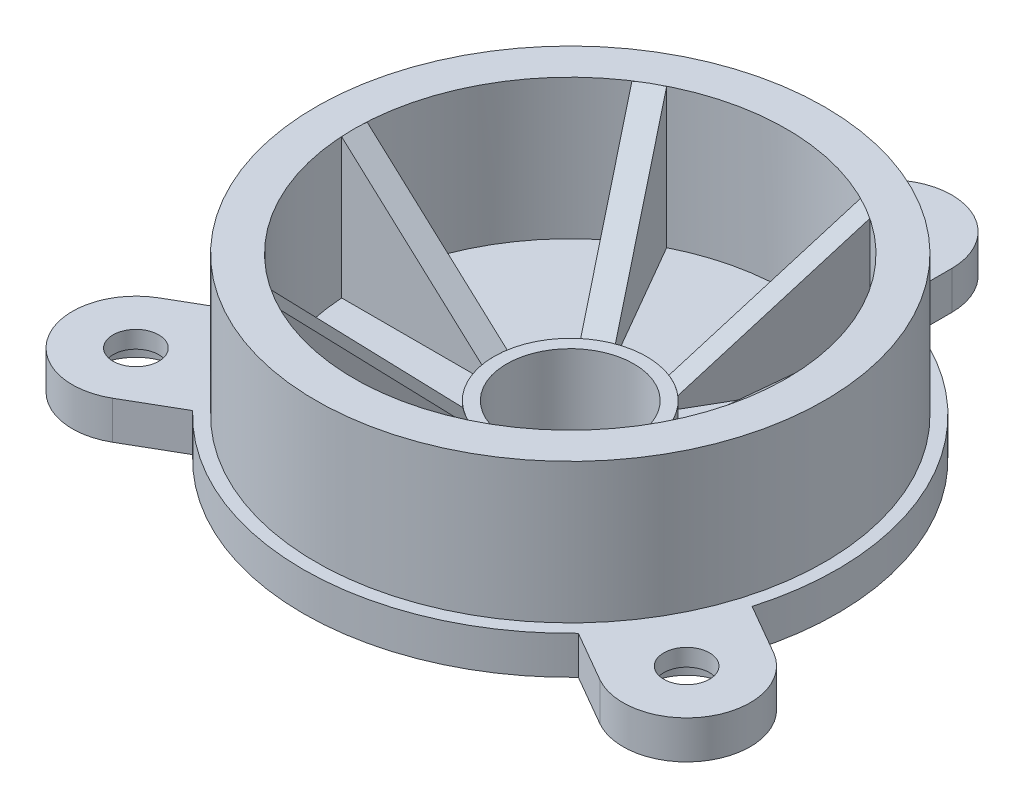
from build123d import *

# Parameters (mm, degrees)
BOSS_EXTRUDE1_DEPTH             = 3
CBORE_FOR_M3_SBHCS1_D           = 3.6
CBORE_FOR_M3_SBHCS1_CBORE_D     = 6.7
CBORE_FOR_M3_SBHCS1_CBORE_DEPTH = 1.65
CIRPATTERN1_COUNT               = 6
RIB1_REACH                      = 45.2
SKETCH5_WALL_W                  = 103.26644724
SKETCH5_WALL_H                  = 2
CIRPATTERN2_COUNT               = 6


with BuildPart() as part:
    # Sketch1 → Revolve1 (revolve)
    with BuildSketch(Plane(origin=(0, 0, 0), x_dir=(0, 0, -1), z_dir=(1, 0, 0))):
        Polygon((6, 6), (5, 6), (5, 0), (10, 0), (10, 2), (21, 2), (21, 5), (20, 5), (20, 16), (17, 16), (17, 5), (6, 5), align=None)
    revolve(axis=Axis((0, 0, 0), (0, 1, 0)))

    # Sketch2 → Boss-Extrude1 (add)
    with BuildSketch(Plane(origin=(0, 5, 0), x_dir=(1, 0, 0), z_dir=(0, 1, 0))):
        with BuildLine():
            Line((5, 25), (5, 19.364916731))
            ThreePointArc((5, 19.364916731), (0, 20), (-5, 19.364916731))
            Line((-5, 19.364916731), (-5, 25))
            ThreePointArc((-5, 25), (0, 30), (5, 25))
        make_face()
    boss_extrude1 = extrude(amount=-BOSS_EXTRUDE1_DEPTH)

    # CBORE for M3 SBHCS1 (through all)
    with Locations(Plane(origin=(0, 2, 0), x_dir=(-1, 0, 0), z_dir=(0, -1, 0))):
        with Locations((0, 25)):
            cbore_for_m3_sbhcs1 = CounterBoreHole(CBORE_FOR_M3_SBHCS1_D / 2, CBORE_FOR_M3_SBHCS1_CBORE_D / 2, CBORE_FOR_M3_SBHCS1_CBORE_DEPTH)

    # CirPattern1: Boss-Extrude1, CBORE for M3 SBHCS1 ×6 about axis, 3 skipped
    cirpattern1_axis = Axis((0, 2, 0), (0, -1, 0))
    add([boss_extrude1.rotate(cirpattern1_axis, i * 360 / CIRPATTERN1_COUNT) for i in range(1, CIRPATTERN1_COUNT) if i not in (1, 3, 5)])
    add([cbore_for_m3_sbhcs1.rotate(cirpattern1_axis, i * 360 / CIRPATTERN1_COUNT) for i in range(1, CIRPATTERN1_COUNT) if i not in (1, 3, 5)], mode=Mode.SUBTRACT)

    # Sketch5 wall → Rib1 (add, up to next)
    with BuildSketch(Plane(origin=(-11.5, 11, 0), x_dir=(-0.739940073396, 0.672672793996, 0), z_dir=(-0.672672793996, -0.739940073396, 0)), mode=Mode.PRIVATE) as rib1_sk1:
        Rectangle(SKETCH5_WALL_W, SKETCH5_WALL_H)
    rib1_tool1 = extrude(rib1_sk1.sketch, amount=RIB1_REACH, mode=Mode.PRIVATE) - part.part
    rib1 = rib1_tool1.solids().sort_by_distance((-11.5, 11, 0))[0]
    add(rib1)

    # CirPattern2: Rib1 ×6 about axis
    cirpattern2_axis = Axis((0, 0, 0), (0, 1, 0))
    for i in range(1, CIRPATTERN2_COUNT):
        add(rib1.rotate(cirpattern2_axis, i * 360 / CIRPATTERN2_COUNT))


solid = part.part
